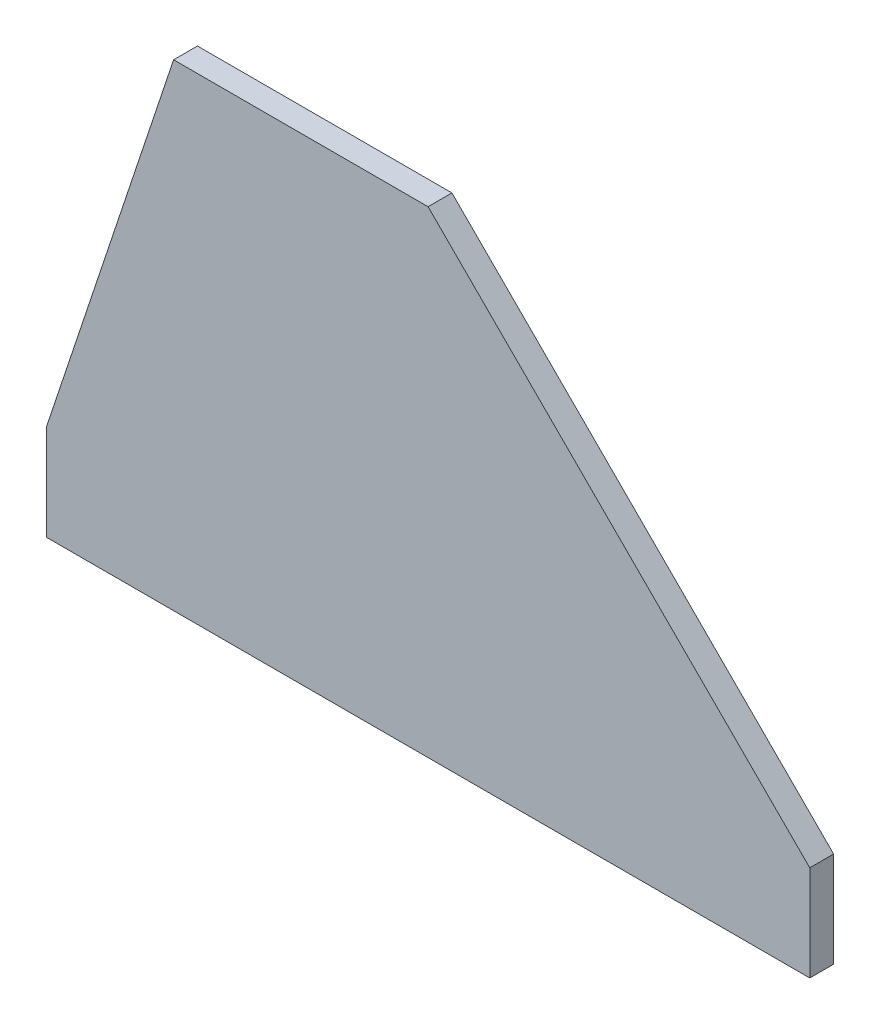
ISO-10303-21;
HEADER;
FILE_DESCRIPTION(('STEP AP214'),'2;1');
FILE_NAME('part.step','',(''),(''),'','','');
FILE_SCHEMA(('AUTOMOTIVE_DESIGN { 1 0 10303 214 1 1 1 1 }'));
ENDSEC;
DATA;
#1=APPLICATION_CONTEXT('core data for automotive mechanical design processes');
#2=APPLICATION_PROTOCOL_DEFINITION('international standard','automotive_design',2000,#1);
#3=PRODUCT_CONTEXT('',#1,'mechanical');
#4=PRODUCT('Part','Part','',(#3));
#5=PRODUCT_RELATED_PRODUCT_CATEGORY('part','',(#4));
#6=PRODUCT_DEFINITION_FORMATION('','',#4);
#7=PRODUCT_DEFINITION_CONTEXT('part definition',#1,'design');
#8=PRODUCT_DEFINITION('design','',#6,#7);
#9=PRODUCT_DEFINITION_SHAPE('','',#8);
#10=(LENGTH_UNIT() NAMED_UNIT(*) SI_UNIT(.MILLI.,.METRE.));
#11=(NAMED_UNIT(*) PLANE_ANGLE_UNIT() SI_UNIT($,.RADIAN.));
#12=(NAMED_UNIT(*) SI_UNIT($,.STERADIAN.) SOLID_ANGLE_UNIT());
#13=UNCERTAINTY_MEASURE_WITH_UNIT(LENGTH_MEASURE(1.E-05),#10,'distance_accuracy_value','');
#14=(GEOMETRIC_REPRESENTATION_CONTEXT(3) GLOBAL_UNCERTAINTY_ASSIGNED_CONTEXT((#13)) GLOBAL_UNIT_ASSIGNED_CONTEXT((#10,
#11,#12)) REPRESENTATION_CONTEXT('',''));
#15=CARTESIAN_POINT('',(0.,0.,0.));
#16=DIRECTION('',(0.,0.,1.));
#17=DIRECTION('',(1.,0.,0.));
#18=AXIS2_PLACEMENT_3D('',#15,#16,#17);
#19=CARTESIAN_POINT('',(0.,-19.05,4.7625));
#20=DIRECTION('',(1.,0.,0.));
#21=DIRECTION('',(0.,0.,-1.));
#22=AXIS2_PLACEMENT_3D('',#19,#20,#21);
#23=PLANE('',#22);
#24=DIRECTION('',(0.,-1.,0.));
#25=VECTOR('',#24,1.);
#26=CARTESIAN_POINT('',(0.,-19.05,0.));
#27=LINE('',#26,#25);
#28=CARTESIAN_POINT('',(0.,0.,0.));
#29=VERTEX_POINT('',#28);
#30=CARTESIAN_POINT('',(0.,-19.05,0.));
#31=VERTEX_POINT('',#30);
#32=EDGE_CURVE('E86',#29,#31,#27,.T.);
#33=ORIENTED_EDGE('',*,*,#32,.T.);
#34=DIRECTION('',(0.,0.,-1.));
#35=VECTOR('',#34,1.);
#36=CARTESIAN_POINT('',(0.,-19.05,4.7625));
#37=LINE('',#36,#35);
#38=CARTESIAN_POINT('',(0.,-19.05,4.7625));
#39=VERTEX_POINT('',#38);
#40=EDGE_CURVE('E11',#39,#31,#37,.T.);
#41=ORIENTED_EDGE('',*,*,#40,.F.);
#42=DIRECTION('',(0.,-1.,0.));
#43=VECTOR('',#42,1.);
#44=CARTESIAN_POINT('',(0.,-19.05,4.7625));
#45=LINE('',#44,#43);
#46=CARTESIAN_POINT('',(0.,0.,4.7625));
#47=VERTEX_POINT('',#46);
#48=EDGE_CURVE('E109',#47,#39,#45,.T.);
#49=ORIENTED_EDGE('',*,*,#48,.F.);
#50=DIRECTION('',(0.,0.,-1.));
#51=VECTOR('',#50,1.);
#52=CARTESIAN_POINT('',(0.,0.,4.7625));
#53=LINE('',#52,#51);
#54=EDGE_CURVE('E99',#47,#29,#53,.T.);
#55=ORIENTED_EDGE('',*,*,#54,.T.);
#56=EDGE_LOOP('',(#33,#41,#49,#55));
#57=FACE_BOUND('',#56,.T.);
#58=ADVANCED_FACE('F30',(#57),#23,.F.);
#59=CARTESIAN_POINT('',(152.4,-19.05,4.7625));
#60=DIRECTION('',(0.,1.,0.));
#61=DIRECTION('',(-1.,0.,0.));
#62=AXIS2_PLACEMENT_3D('',#59,#60,#61);
#63=PLANE('',#62);
#64=DIRECTION('',(1.,0.,0.));
#65=VECTOR('',#64,1.);
#66=CARTESIAN_POINT('',(152.4,-19.05,0.));
#67=LINE('',#66,#65);
#68=CARTESIAN_POINT('',(152.4,-19.05,0.));
#69=VERTEX_POINT('',#68);
#70=EDGE_CURVE('E82',#31,#69,#67,.T.);
#71=ORIENTED_EDGE('',*,*,#70,.T.);
#72=DIRECTION('',(0.,0.,-1.));
#73=VECTOR('',#72,1.);
#74=CARTESIAN_POINT('',(152.4,-19.05,4.7625));
#75=LINE('',#74,#73);
#76=CARTESIAN_POINT('',(152.4,-19.05,4.7625));
#77=VERTEX_POINT('',#76);
#78=EDGE_CURVE('E37',#77,#69,#75,.T.);
#79=ORIENTED_EDGE('',*,*,#78,.F.);
#80=DIRECTION('',(1.,0.,0.));
#81=VECTOR('',#80,1.);
#82=CARTESIAN_POINT('',(152.4,-19.05,4.7625));
#83=LINE('',#82,#81);
#84=EDGE_CURVE('E95',#39,#77,#83,.T.);
#85=ORIENTED_EDGE('',*,*,#84,.F.);
#86=ORIENTED_EDGE('',*,*,#40,.T.);
#87=EDGE_LOOP('',(#71,#79,#85,#86));
#88=FACE_BOUND('',#87,.T.);
#89=ADVANCED_FACE('F94',(#88),#63,.F.);
#90=CARTESIAN_POINT('',(152.4,0.,4.7625));
#91=DIRECTION('',(-1.,0.,0.));
#92=DIRECTION('',(0.,0.,1.));
#93=AXIS2_PLACEMENT_3D('',#90,#91,#92);
#94=PLANE('',#93);
#95=DIRECTION('',(0.,1.,0.));
#96=VECTOR('',#95,1.);
#97=CARTESIAN_POINT('',(152.4,0.,0.));
#98=LINE('',#97,#96);
#99=CARTESIAN_POINT('',(152.4,0.,0.));
#100=VERTEX_POINT('',#99);
#101=EDGE_CURVE('E88',#69,#100,#98,.T.);
#102=ORIENTED_EDGE('',*,*,#101,.T.);
#103=DIRECTION('',(0.,0.,-1.));
#104=VECTOR('',#103,1.);
#105=CARTESIAN_POINT('',(152.4,0.,4.7625));
#106=LINE('',#105,#104);
#107=CARTESIAN_POINT('',(152.4,0.,4.7625));
#108=VERTEX_POINT('',#107);
#109=EDGE_CURVE('E125',#108,#100,#106,.T.);
#110=ORIENTED_EDGE('',*,*,#109,.F.);
#111=DIRECTION('',(0.,1.,0.));
#112=VECTOR('',#111,1.);
#113=CARTESIAN_POINT('',(152.4,0.,4.7625));
#114=LINE('',#113,#112);
#115=EDGE_CURVE('E112',#77,#108,#114,.T.);
#116=ORIENTED_EDGE('',*,*,#115,.F.);
#117=ORIENTED_EDGE('',*,*,#78,.T.);
#118=EDGE_LOOP('',(#102,#110,#116,#117));
#119=FACE_BOUND('',#118,.T.);
#120=ADVANCED_FACE('F129',(#119),#94,.F.);
#121=CARTESIAN_POINT('',(152.4,0.,4.7625));
#122=DIRECTION('',(-0.707106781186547,-0.707106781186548,0.));
#123=DIRECTION('',(0.707106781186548,-0.707106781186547,0.));
#124=AXIS2_PLACEMENT_3D('',#121,#122,#123);
#125=PLANE('',#124);
#126=DIRECTION('',(-0.707106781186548,0.707106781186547,0.));
#127=VECTOR('',#126,1.);
#128=CARTESIAN_POINT('',(152.4,0.,0.));
#129=LINE('',#128,#127);
#130=CARTESIAN_POINT('',(76.2,76.2,0.));
#131=VERTEX_POINT('',#130);
#132=EDGE_CURVE('E103',#100,#131,#129,.T.);
#133=ORIENTED_EDGE('',*,*,#132,.T.);
#134=DIRECTION('',(0.,0.,-1.));
#135=VECTOR('',#134,1.);
#136=CARTESIAN_POINT('',(76.2,76.2,4.7625));
#137=LINE('',#136,#135);
#138=CARTESIAN_POINT('',(76.2,76.2,4.7625));
#139=VERTEX_POINT('',#138);
#140=EDGE_CURVE('E122',#139,#131,#137,.T.);
#141=ORIENTED_EDGE('',*,*,#140,.F.);
#142=DIRECTION('',(-0.707106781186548,0.707106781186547,0.));
#143=VECTOR('',#142,1.);
#144=CARTESIAN_POINT('',(152.4,0.,4.7625));
#145=LINE('',#144,#143);
#146=EDGE_CURVE('E114',#108,#139,#145,.T.);
#147=ORIENTED_EDGE('',*,*,#146,.F.);
#148=ORIENTED_EDGE('',*,*,#109,.T.);
#149=EDGE_LOOP('',(#133,#141,#147,#148));
#150=FACE_BOUND('',#149,.T.);
#151=ADVANCED_FACE('F135',(#150),#125,.F.);
#152=CARTESIAN_POINT('',(76.2,76.2,4.7625));
#153=DIRECTION('',(0.,-1.,0.));
#154=DIRECTION('',(1.,0.,0.));
#155=AXIS2_PLACEMENT_3D('',#152,#153,#154);
#156=PLANE('',#155);
#157=DIRECTION('',(-1.,0.,0.));
#158=VECTOR('',#157,1.);
#159=CARTESIAN_POINT('',(76.2,76.2,0.));
#160=LINE('',#159,#158);
#161=CARTESIAN_POINT('',(25.4,76.2,0.));
#162=VERTEX_POINT('',#161);
#163=EDGE_CURVE('E105',#131,#162,#160,.T.);
#164=ORIENTED_EDGE('',*,*,#163,.T.);
#165=DIRECTION('',(0.,0.,-1.));
#166=VECTOR('',#165,1.);
#167=CARTESIAN_POINT('',(25.4,76.2,4.7625));
#168=LINE('',#167,#166);
#169=CARTESIAN_POINT('',(25.4,76.2,4.7625));
#170=VERTEX_POINT('',#169);
#171=EDGE_CURVE('E119',#170,#162,#168,.T.);
#172=ORIENTED_EDGE('',*,*,#171,.F.);
#173=DIRECTION('',(-1.,0.,0.));
#174=VECTOR('',#173,1.);
#175=CARTESIAN_POINT('',(76.2,76.2,4.7625));
#176=LINE('',#175,#174);
#177=EDGE_CURVE('E49',#139,#170,#176,.T.);
#178=ORIENTED_EDGE('',*,*,#177,.F.);
#179=ORIENTED_EDGE('',*,*,#140,.T.);
#180=EDGE_LOOP('',(#164,#172,#178,#179));
#181=FACE_BOUND('',#180,.T.);
#182=ADVANCED_FACE('F138',(#181),#156,.F.);
#183=CARTESIAN_POINT('',(25.4,76.2,4.7625));
#184=DIRECTION('',(0.948683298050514,-0.316227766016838,0.));
#185=DIRECTION('',(0.316227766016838,0.948683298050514,0.));
#186=AXIS2_PLACEMENT_3D('',#183,#184,#185);
#187=PLANE('',#186);
#188=DIRECTION('',(-0.316227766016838,-0.948683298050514,0.));
#189=VECTOR('',#188,1.);
#190=CARTESIAN_POINT('',(25.4,76.2,0.));
#191=LINE('',#190,#189);
#192=EDGE_CURVE('E107',#162,#29,#191,.T.);
#193=ORIENTED_EDGE('',*,*,#192,.T.);
#194=ORIENTED_EDGE('',*,*,#54,.F.);
#195=DIRECTION('',(-0.316227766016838,-0.948683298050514,0.));
#196=VECTOR('',#195,1.);
#197=CARTESIAN_POINT('',(25.4,76.2,4.7625));
#198=LINE('',#197,#196);
#199=EDGE_CURVE('E44',#170,#47,#198,.T.);
#200=ORIENTED_EDGE('',*,*,#199,.F.);
#201=ORIENTED_EDGE('',*,*,#171,.T.);
#202=EDGE_LOOP('',(#193,#194,#200,#201));
#203=FACE_BOUND('',#202,.T.);
#204=ADVANCED_FACE('F140',(#203),#187,.F.);
#205=CARTESIAN_POINT('',(0.,-19.05,4.7625));
#206=DIRECTION('',(0.,0.,1.));
#207=DIRECTION('',(1.,0.,0.));
#208=AXIS2_PLACEMENT_3D('',#205,#206,#207);
#209=PLANE('',#208);
#210=ORIENTED_EDGE('',*,*,#48,.T.);
#211=ORIENTED_EDGE('',*,*,#84,.T.);
#212=ORIENTED_EDGE('',*,*,#115,.T.);
#213=ORIENTED_EDGE('',*,*,#146,.T.);
#214=ORIENTED_EDGE('',*,*,#177,.T.);
#215=ORIENTED_EDGE('',*,*,#199,.T.);
#216=EDGE_LOOP('',(#210,#211,#212,#213,#214,#215));
#217=FACE_BOUND('',#216,.T.);
#218=ADVANCED_FACE('F132',(#217),#209,.T.);
#219=CARTESIAN_POINT('',(0.,-19.05,0.));
#220=DIRECTION('',(0.,0.,1.));
#221=DIRECTION('',(1.,0.,0.));
#222=AXIS2_PLACEMENT_3D('',#219,#220,#221);
#223=PLANE('',#222);
#224=ORIENTED_EDGE('',*,*,#32,.F.);
#225=ORIENTED_EDGE('',*,*,#192,.F.);
#226=ORIENTED_EDGE('',*,*,#163,.F.);
#227=ORIENTED_EDGE('',*,*,#132,.F.);
#228=ORIENTED_EDGE('',*,*,#101,.F.);
#229=ORIENTED_EDGE('',*,*,#70,.F.);
#230=EDGE_LOOP('',(#224,#225,#226,#227,#228,#229));
#231=FACE_BOUND('',#230,.T.);
#232=ADVANCED_FACE('F83',(#231),#223,.F.);
#233=CLOSED_SHELL('',(#58,#89,#120,#151,#182,#204,#218,#232));
#234=MANIFOLD_SOLID_BREP('B2',#233);
#235=ADVANCED_BREP_SHAPE_REPRESENTATION('',(#18,#234),#14);
#236=SHAPE_DEFINITION_REPRESENTATION(#9,#235);
ENDSEC;
END-ISO-10303-21;
